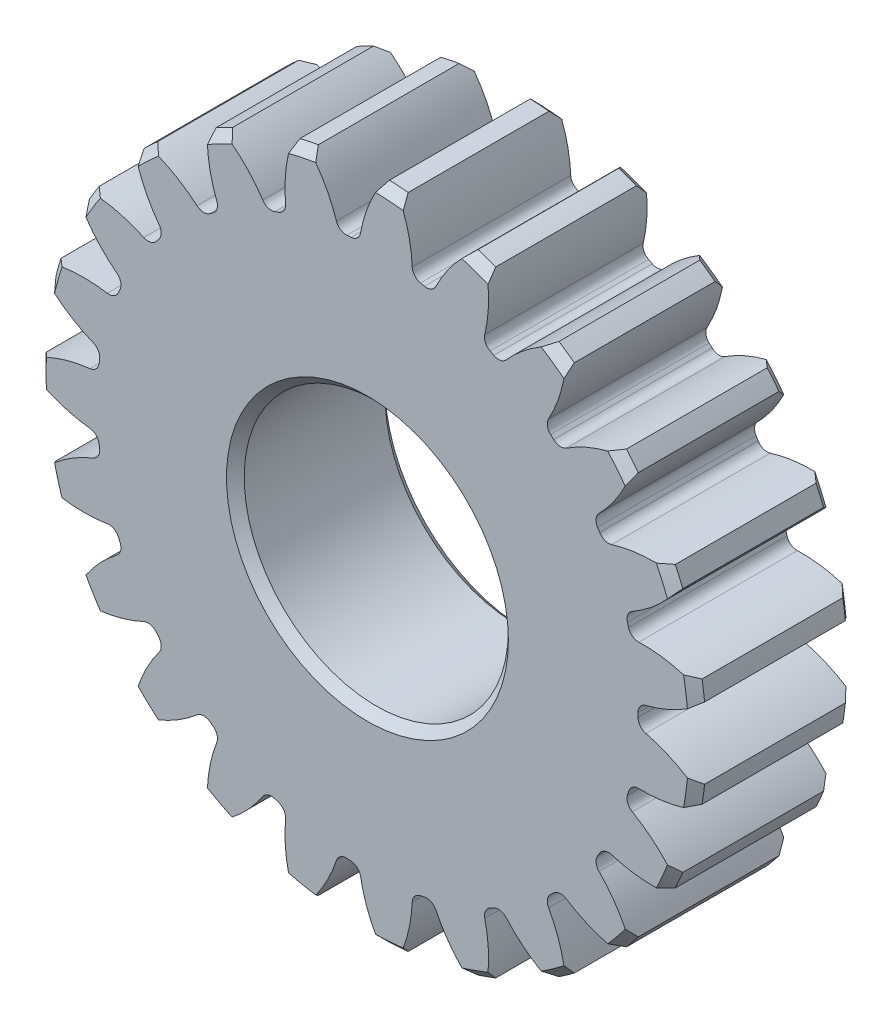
from build123d import *

# Parameters (mm, degrees)
BOSS_EXTRUDE1_DEPTH      = 0.6
BOSS_EXTRUDE1_DEPTH_BACK = 0.6
SKETCH3_R                = 2.5
SKETCH5_W                = 1.2
SKETCH5_H                = 1
CHAMFER2_SIZE            = 0.067101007
CUT_EXTRUDE1_DEPTH       = 4.586084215
FILLET1_R                = 0.078539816
CIRPATTERN1_COUNT        = 23
FILLET1_OF_CIRPATTERN1_R = 0.078539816


with BuildPart() as part:
    # Sketch3 → Boss-Extrude1 (new, two sides: drawn at the far end of the back side and taken through both)
    with BuildSketch(Plane.XY.offset(-BOSS_EXTRUDE1_DEPTH_BACK)):
        Circle(SKETCH3_R)
    extrude(amount=BOSS_EXTRUDE1_DEPTH + BOSS_EXTRUDE1_DEPTH_BACK)

    # Sketch5 → Cut-Revolve1 (revolve, cut)
    with BuildSketch(Plane(origin=(0, 0, 0), x_dir=(0, 0, -1), z_dir=(1, 0, 0)), mode=Mode.PRIVATE) as cut_revolve1_sk:
        with Locations((0, 0.5)):
            Rectangle(SKETCH5_W, SKETCH5_H)
    revolve(cut_revolve1_sk.sketch.rotate(Axis((0, 0, 0.6), (0, 0, -1)), 90), axis=Axis((0, 0, 0.6), (0, 0, -1)), mode=Mode.SUBTRACT)

    # Chamfer2
    chamfer2_edges = [part.edges().sort_by_distance(p)[0] for p in [
        (-2.5, 0, -0.6),
        (-2.5, 0, 0.6),
        (-1, 0, 0.6),
        (-1, 0, -0.6),
    ]]
    chamfer(chamfer2_edges, length=CHAMFER2_SIZE)

    # Sketch4 → Cut-Extrude1 (cut, symmetric)
    with BuildSketch(Plane.XY):
        with BuildLine():
            Line((2.048494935, -0.078539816), (2.048494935, 0.078539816))
            ThreePointArc((2.048494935, 0.078539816), (2.277606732, 0.149846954), (2.485393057, 0.269854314))
            ThreePointArc((2.485393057, 0.269854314), (2.5, 0), (2.485393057, -0.269854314))
            ThreePointArc((2.485393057, -0.269854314), (2.277606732, -0.149846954), (2.048494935, -0.078539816))
        make_face()
    cut_extrude1 = extrude(amount=CUT_EXTRUDE1_DEPTH, both=True, mode=Mode.SUBTRACT)

    # Fillet1
    fillet1_edges = [part.edges().sort_by_distance(p)[0] for p in [
        (2.048494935, 0.078539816, 0),
        (2.048494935, -0.078539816, 0),
    ]]
    fillet(fillet1_edges, radius=FILLET1_R)

    # CirPattern1: Cut-Extrude1 ×23 about axis
    cirpattern1_axis = Axis((0, 0, 0), (0, 0, 1))
    for i in range(1, CIRPATTERN1_COUNT):
        add(cut_extrude1.rotate(cirpattern1_axis, i * 360 / CIRPATTERN1_COUNT), mode=Mode.SUBTRACT)

    # Fillet1 of CirPattern1
    fillet1_of_cirpattern1_edges = [part.edges().sort_by_distance(p)[0] for p in [
        (1.951341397, 0.628304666, 0),
        (1.993720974, 0.477049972, 0),
        (1.709465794, 1.131471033, 0),
        (1.79108185, 0.997259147, 0),
        (1.340806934, 1.550721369, 0),
        (1.455606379, 1.443506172, 0),
        (0.872706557, 1.854961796, 0),
        (1.012175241, 1.782694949, 0),
        (0.339881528, 2.021628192, 0),
        (0.493675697, 1.989669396, 0),
        (-0.21815096, 2.038359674, 0),
        (-0.061437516, 2.049079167, 0),
        (-0.760004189, 1.903915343, 0),
        (-0.611994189, 1.956518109, 0),
        (-1.245491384, 1.628266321, 0),
        (-1.117162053, 1.718851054, 0),
        (-1.638606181, 1.231856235, 0),
        (-1.539475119, 1.35370468, 0),
        (-1.910193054, 0.744085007, 0),
        (-1.847612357, 0.888160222, 0),
        (-2.040109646, 0.201128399, 0),
        (-2.018720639, 0.356744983, 0),
        (-2.018720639, -0.356744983, 0),
        (-2.040109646, -0.201128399, 0),
        (-1.847612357, -0.888160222, 0),
        (-1.910193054, -0.744085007, 0),
        (-1.539475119, -1.35370468, 0),
        (-1.638606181, -1.231856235, 0),
        (-1.117162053, -1.718851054, 0),
        (-1.245491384, -1.628266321, 0),
        (-0.611994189, -1.956518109, 0),
        (-0.760004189, -1.903915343, 0),
        (-0.061437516, -2.049079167, 0),
        (-0.21815096, -2.038359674, 0),
        (0.493675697, -1.989669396, 0),
        (0.339881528, -2.021628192, 0),
        (1.012175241, -1.782694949, 0),
        (0.872706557, -1.854961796, 0),
        (1.455606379, -1.443506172, 0),
        (1.340806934, -1.550721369, 0),
        (1.79108185, -0.997259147, 0),
        (1.709465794, -1.131471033, 0),
        (1.993720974, -0.477049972, 0),
        (1.951341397, -0.628304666, 0),
    ]]
    fillet(fillet1_of_cirpattern1_edges, radius=FILLET1_OF_CIRPATTERN1_R)


solid = part.part
